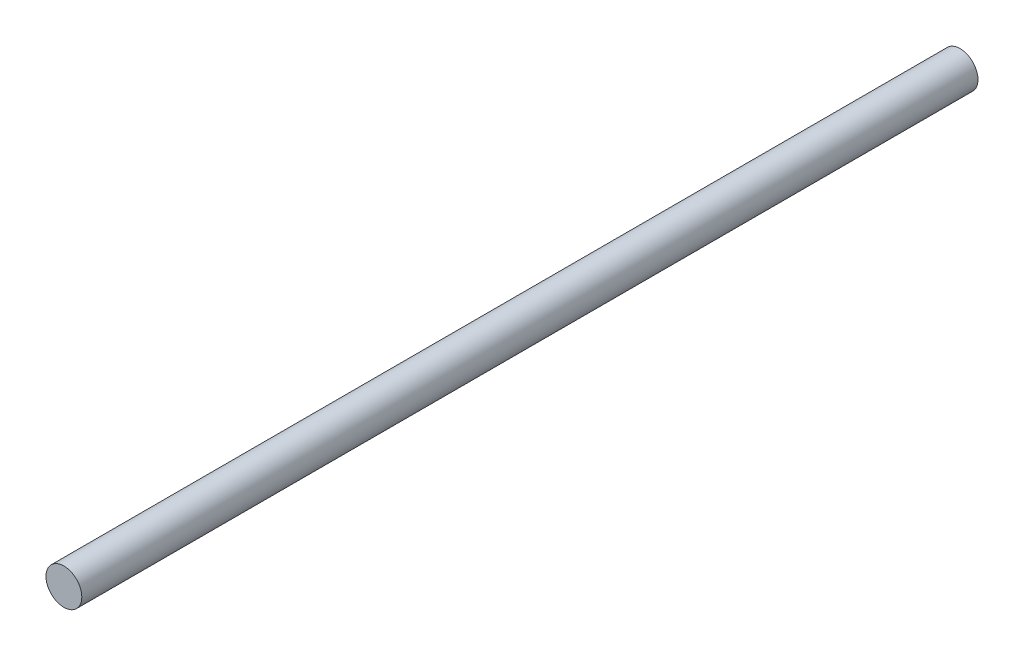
from build123d import *

# Parameters (mm, degrees)
SKETCH1_R           = 6
BOSS_EXTRUDE1_DEPTH = 300


with BuildPart() as part:
    # Sketch1 → Boss-Extrude1 (new body)
    with BuildSketch(Plane.XY):
        Circle(SKETCH1_R)
    extrude(amount=BOSS_EXTRUDE1_DEPTH)


solid = part.part
